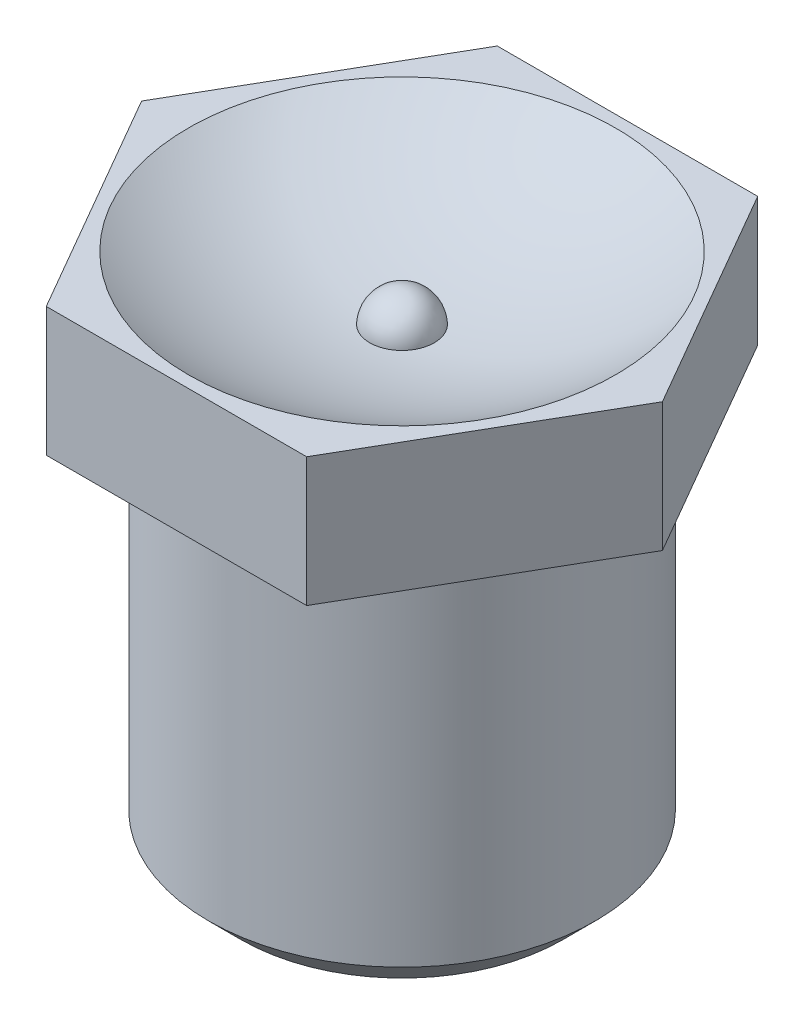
from build123d import *
from build123d.topology import SkipClean

# Parameters (mm, degrees)
ESQUISSE1_R      = 3
EXTRUSION1_DEPTH = 6
EXTRUSION2_DEPTH = 2
CHANFREIN1_SIZE  = 0.5


with BuildPart() as part:
    # Esquisse1 → Extrusion1 (new body)
    with BuildSketch(Plane(origin=(0, 0, 0), x_dir=(1, 0, 0), z_dir=(0, 1, 0))):
        with Locations(Location((0, 0, 0), (0, 0, 270))):
            Circle(ESQUISSE1_R)
    extrude(amount=-EXTRUSION1_DEPTH)

    # Esquisse2 → Extrusion2 (add)
    with BuildSketch(Plane(origin=(0, 0, 0), x_dir=(-1, 0, 0), z_dir=(0, 1, 0))):
        Polygon((-2.020725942, 3.5), (-4.041451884, 0), (-2.020725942, -3.5), (2.020725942, -3.5), (4.041451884, 0), (2.020725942, 3.5), align=None)
    extrude(amount=EXTRUSION2_DEPTH)

    # Chanfrein1
    chanfrein1_edges = [part.edges().sort_by_distance(p)[0] for p in [
        (0, -6, -3),
    ]]
    chamfer(chanfrein1_edges, length=CHANFREIN1_SIZE)

    # Esquisse3 → Enl_vement de mati_re-R_volution1 (revolve, cut)
    with SkipClean():  # the faces are left unmerged after this step: merging them gives an invalid solid
        with BuildSketch(Plane.XY):
            with BuildLine():
                Line((-6, 7), (6, 7))
                ThreePointArc((6, 7), (0, 1), (-6, 7))
            make_face()
        revolve(axis=Axis((-7.612149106, 7, 0), (1, 0, 0)), mode=Mode.SUBTRACT)

    # Esquisse4 → R_volution1 (revolve)
    with SkipClean():  # the faces are left unmerged after this step: merging them gives an invalid solid
        with BuildSketch(Plane.XY):
            with BuildLine():
                Line((-0.5, 1), (0.5, 1))
                ThreePointArc((0.5, 1), (0, 1.5), (-0.5, 1))
            make_face()
        revolve(axis=Axis((-1.567203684, 1, 0), (1, 0, 0)))


solid = part.part
